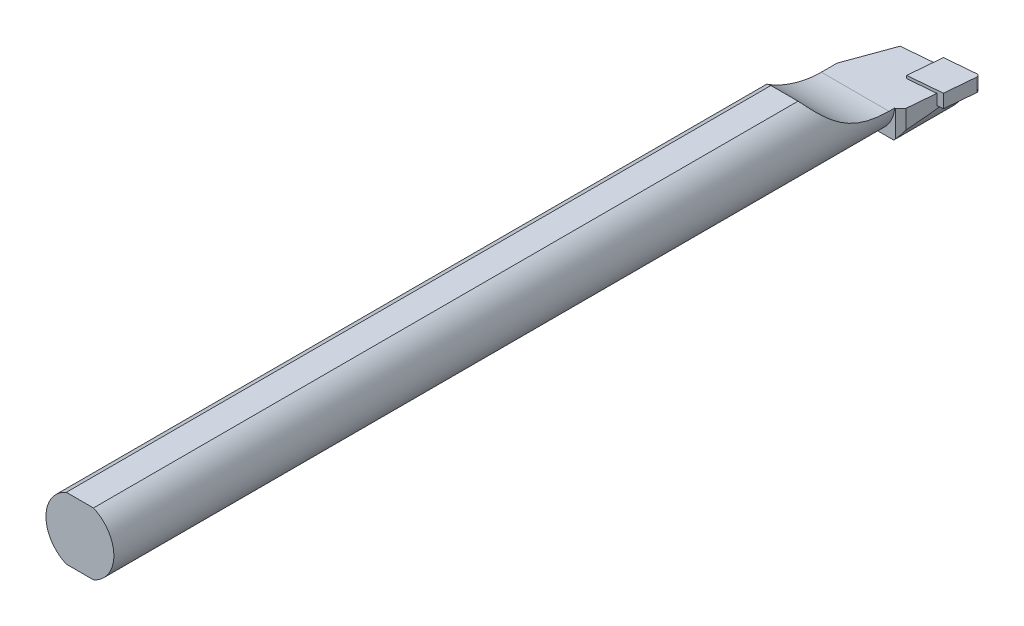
ISO-10303-21;
HEADER;
FILE_DESCRIPTION(('STEP AP214'),'2;1');
FILE_NAME('part.step','',(''),(''),'','','');
FILE_SCHEMA(('AUTOMOTIVE_DESIGN { 1 0 10303 214 1 1 1 1 }'));
ENDSEC;
DATA;
#1=APPLICATION_CONTEXT('core data for automotive mechanical design processes');
#2=APPLICATION_PROTOCOL_DEFINITION('international standard','automotive_design',2000,#1);
#3=PRODUCT_CONTEXT('',#1,'mechanical');
#4=PRODUCT('Part','Part','',(#3));
#5=PRODUCT_RELATED_PRODUCT_CATEGORY('part','',(#4));
#6=PRODUCT_DEFINITION_FORMATION('','',#4);
#7=PRODUCT_DEFINITION_CONTEXT('part definition',#1,'design');
#8=PRODUCT_DEFINITION('design','',#6,#7);
#9=PRODUCT_DEFINITION_SHAPE('','',#8);
#10=(LENGTH_UNIT() NAMED_UNIT(*) SI_UNIT(.MILLI.,.METRE.));
#11=(NAMED_UNIT(*) PLANE_ANGLE_UNIT() SI_UNIT($,.RADIAN.));
#12=(NAMED_UNIT(*) SI_UNIT($,.STERADIAN.) SOLID_ANGLE_UNIT());
#13=UNCERTAINTY_MEASURE_WITH_UNIT(LENGTH_MEASURE(1.E-05),#10,'distance_accuracy_value','');
#14=(GEOMETRIC_REPRESENTATION_CONTEXT(3) GLOBAL_UNCERTAINTY_ASSIGNED_CONTEXT((#13)) GLOBAL_UNIT_ASSIGNED_CONTEXT((#10,
#11,#12)) REPRESENTATION_CONTEXT('',''));
#15=CARTESIAN_POINT('',(0.,0.,0.));
#16=DIRECTION('',(0.,0.,1.));
#17=DIRECTION('',(1.,0.,0.));
#18=AXIS2_PLACEMENT_3D('',#15,#16,#17);
#19=CARTESIAN_POINT('',(-8.99999999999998,0.,150.));
#20=DIRECTION('',(0.,0.,1.));
#21=DIRECTION('',(1.,0.,0.));
#22=AXIS2_PLACEMENT_3D('',#19,#20,#21);
#23=CYLINDRICAL_SURFACE('',#22,6.00000000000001);
#24=CARTESIAN_POINT('',(-9.,0.,1.79121780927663));
#25=DIRECTION('',(0.0871557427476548,0.,0.996194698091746));
#26=DIRECTION('',(-0.996194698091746,0.,0.0871557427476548));
#27=AXIS2_PLACEMENT_3D('',#24,#25,#26);
#28=ELLIPSE('',#27,6.02291902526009,6.00000000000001);
#29=CARTESIAN_POINT('',(-12.,-5.19615242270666,2.05368379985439));
#30=VERTEX_POINT('',#29);
#31=CARTESIAN_POINT('',(-11.3979157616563,-5.50000000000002,2.00100825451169));
#32=VERTEX_POINT('',#31);
#33=EDGE_CURVE('E167',#30,#32,#28,.T.);
#34=ORIENTED_EDGE('',*,*,#33,.T.);
#35=DIRECTION('',(0.,0.,1.));
#36=VECTOR('',#35,1.);
#37=CARTESIAN_POINT('',(-11.3979157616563,-5.50000000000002,150.));
#38=LINE('',#37,#36);
#39=CARTESIAN_POINT('',(-11.3979157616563,-5.50000000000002,150.));
#40=VERTEX_POINT('',#39);
#41=EDGE_CURVE('E156',#32,#40,#38,.T.);
#42=ORIENTED_EDGE('',*,*,#41,.T.);
#43=CARTESIAN_POINT('',(-8.99999999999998,0.,150.));
#44=DIRECTION('',(0.,0.,1.));
#45=DIRECTION('',(1.,0.,0.));
#46=AXIS2_PLACEMENT_3D('',#43,#44,#45);
#47=CIRCLE('',#46,6.00000000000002);
#48=CARTESIAN_POINT('',(-11.3979157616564,5.49999999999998,150.));
#49=VERTEX_POINT('',#48);
#50=EDGE_CURVE('E165',#49,#40,#47,.T.);
#51=ORIENTED_EDGE('',*,*,#50,.F.);
#52=DIRECTION('',(0.,0.,1.));
#53=VECTOR('',#52,1.);
#54=CARTESIAN_POINT('',(-11.3979157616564,5.49999999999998,150.));
#55=LINE('',#54,#53);
#56=CARTESIAN_POINT('',(-11.3979157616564,5.5,25.4899959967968));
#57=VERTEX_POINT('',#56);
#58=EDGE_CURVE('E303',#49,#57,#55,.F.);
#59=ORIENTED_EDGE('',*,*,#58,.T.);
#60=CARTESIAN_POINT('',(-3.02086962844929,-0.5,13.));
#61=CARTESIAN_POINT('',(-3.02089370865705,-0.500003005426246,13.2238125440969));
#62=CARTESIAN_POINT('',(-3.02047773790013,-0.495303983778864,13.4476242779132));
#63=CARTESIAN_POINT('',(-3.01893904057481,-0.476523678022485,13.8948495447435));
#64=CARTESIAN_POINT('',(-3.01781632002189,-0.4624424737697,14.1182630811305));
#65=CARTESIAN_POINT('',(-3.01503689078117,-0.424911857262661,14.5643911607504));
#66=CARTESIAN_POINT('',(-3.01337996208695,-0.401458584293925,14.7871053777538));
#67=CARTESIAN_POINT('',(-3.00987333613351,-0.345226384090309,15.2313512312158));
#68=CARTESIAN_POINT('',(-3.00802363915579,-0.312447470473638,15.4528828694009));
#69=CARTESIAN_POINT('',(-3.00457726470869,-0.237337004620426,15.8960518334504));
#70=CARTESIAN_POINT('',(-3.00298261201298,-0.194934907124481,16.1176772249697));
#71=CARTESIAN_POINT('',(-3.000661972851,-0.10079597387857,16.5589408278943));
#72=CARTESIAN_POINT('',(-2.99993598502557,-0.0490591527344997,16.7785790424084));
#73=CARTESIAN_POINT('',(-3.00007287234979,0.0636391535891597,17.2154029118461));
#74=CARTESIAN_POINT('',(-3.00093522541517,0.124597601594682,17.4325893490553));
#75=CARTESIAN_POINT('',(-3.00509008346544,0.255627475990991,17.8641511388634));
#76=CARTESIAN_POINT('',(-3.00838243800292,0.325698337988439,18.0785266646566));
#77=CARTESIAN_POINT('',(-3.02069289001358,0.509897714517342,18.6041674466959));
#78=CARTESIAN_POINT('',(-3.03167566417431,0.629247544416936,18.913581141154));
#79=CARTESIAN_POINT('',(-3.06446648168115,0.886723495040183,19.5239441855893));
#80=CARTESIAN_POINT('',(-3.08627476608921,1.02485003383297,19.824893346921));
#81=CARTESIAN_POINT('',(-3.144723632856,1.31835323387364,20.4154719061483));
#82=CARTESIAN_POINT('',(-3.18131048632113,1.47366594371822,20.7051381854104));
#83=CARTESIAN_POINT('',(-3.27395786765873,1.80034860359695,21.2720246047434));
#84=CARTESIAN_POINT('',(-3.3300094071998,1.97171111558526,21.5492504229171));
#85=CARTESIAN_POINT('',(-3.44339242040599,2.26712876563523,21.9964721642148));
#86=CARTESIAN_POINT('',(-3.49375751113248,2.38736803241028,22.170772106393));
#87=CARTESIAN_POINT('',(-3.60672556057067,2.6326449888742,22.5118475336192));
#88=CARTESIAN_POINT('',(-3.66932503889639,2.75768130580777,22.6786251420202));
#89=CARTESIAN_POINT('',(-3.80826175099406,3.01109848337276,23.0034867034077));
#90=CARTESIAN_POINT('',(-3.88458710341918,3.13947636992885,23.1615780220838));
#91=CARTESIAN_POINT('',(-4.05247942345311,3.39790612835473,23.4680207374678));
#92=CARTESIAN_POINT('',(-4.144043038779,3.5279576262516,23.616374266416));
#93=CARTESIAN_POINT('',(-4.32291745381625,3.76054803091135,23.8723815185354));
#94=CARTESIAN_POINT('',(-4.40716052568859,3.86319015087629,23.9820880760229));
#95=CARTESIAN_POINT('',(-4.58649985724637,4.06686954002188,24.1939768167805));
#96=CARTESIAN_POINT('',(-4.68159887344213,4.16790639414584,24.2961570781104));
#97=CARTESIAN_POINT('',(-4.88291459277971,4.36687930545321,24.4923081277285));
#98=CARTESIAN_POINT('',(-4.9891319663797,4.46481517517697,24.5862784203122));
#99=CARTESIAN_POINT('',(-5.21265502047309,4.65592349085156,24.7653365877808));
#100=CARTESIAN_POINT('',(-5.32995502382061,4.74909833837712,24.8504289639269));
#101=CARTESIAN_POINT('',(-5.57654306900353,4.92985989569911,25.0119510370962));
#102=CARTESIAN_POINT('',(-5.70592997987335,5.01738841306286,25.0882953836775));
#103=CARTESIAN_POINT('',(-5.9751907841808,5.18416858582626,25.2309309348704));
#104=CARTESIAN_POINT('',(-6.11506502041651,5.26341997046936,25.2972218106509));
#105=CARTESIAN_POINT('',(-6.40428940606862,5.41190316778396,25.4193214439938));
#106=CARTESIAN_POINT('',(-6.55363444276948,5.4811403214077,25.475135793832));
#107=CARTESIAN_POINT('',(-6.8606150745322,5.60808384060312,25.5760319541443));
#108=CARTESIAN_POINT('',(-7.01824921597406,5.66579221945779,25.6211156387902));
#109=CARTESIAN_POINT('',(-7.31700971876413,5.76094240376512,25.6946377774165));
#110=CARTESIAN_POINT('',(-7.45723124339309,5.8001076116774,25.7245399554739));
#111=CARTESIAN_POINT('',(-7.74155756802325,5.8683634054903,25.7762833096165));
#112=CARTESIAN_POINT('',(-7.88566199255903,5.89745496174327,25.7981252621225));
#113=CARTESIAN_POINT('',(-8.17654082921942,5.94505077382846,25.8336989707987));
#114=CARTESIAN_POINT('',(-8.32331426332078,5.9635588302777,25.847433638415));
#115=CARTESIAN_POINT('',(-8.61835866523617,5.98968105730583,25.866782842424));
#116=CARTESIAN_POINT('',(-8.76662957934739,5.99729561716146,25.8723976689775));
#117=CARTESIAN_POINT('',(-9.0522374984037,6.00134241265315,25.8753836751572));
#118=CARTESIAN_POINT('',(-9.18955802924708,5.99857269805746,25.8733431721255));
#119=CARTESIAN_POINT('',(-9.46345421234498,5.98364642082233,25.8623132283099));
#120=CARTESIAN_POINT('',(-9.60002961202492,5.97148685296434,25.8533215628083));
#121=CARTESIAN_POINT('',(-9.87132314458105,5.93796825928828,25.8284053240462));
#122=CARTESIAN_POINT('',(-10.0060423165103,5.91661461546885,25.8124848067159));
#123=CARTESIAN_POINT('',(-10.2728064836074,5.86501719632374,25.7737287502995));
#124=CARTESIAN_POINT('',(-10.4048504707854,5.83477013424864,25.7508906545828));
#125=CARTESIAN_POINT('',(-10.6645072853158,5.76605068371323,25.6985071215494));
#126=CARTESIAN_POINT('',(-10.7921424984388,5.72763041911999,25.6690041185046));
#127=CARTESIAN_POINT('',(-11.0430691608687,5.642996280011,25.6032673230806));
#128=CARTESIAN_POINT('',(-11.166359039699,5.59677962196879,25.5670311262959));
#129=CARTESIAN_POINT('',(-11.4077814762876,5.49723852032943,25.4879461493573));
#130=CARTESIAN_POINT('',(-11.5259158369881,5.44391658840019,25.4450997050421));
#131=CARTESIAN_POINT('',(-11.756496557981,5.33087432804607,25.3529025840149));
#132=CARTESIAN_POINT('',(-11.8689408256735,5.27115167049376,25.303549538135));
#133=CARTESIAN_POINT('',(-12.0926992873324,5.14320772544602,25.196071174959));
#134=CARTESIAN_POINT('',(-12.2037159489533,5.07471991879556,25.1376439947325));
#135=CARTESIAN_POINT('',(-12.4185303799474,4.93257010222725,25.0140873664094));
#136=CARTESIAN_POINT('',(-12.5223252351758,4.85890602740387,24.9489552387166));
#137=CARTESIAN_POINT('',(-12.722381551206,4.70740065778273,24.8122903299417));
#138=CARTESIAN_POINT('',(-12.8186424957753,4.62955907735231,24.7407571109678));
#139=CARTESIAN_POINT('',(-13.0035083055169,4.47065832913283,24.5916135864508));
#140=CARTESIAN_POINT('',(-13.0921117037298,4.38959854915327,24.5140021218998));
#141=CARTESIAN_POINT('',(-13.2938489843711,4.1939710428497,24.3224935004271));
#142=CARTESIAN_POINT('',(-13.4035292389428,4.0783627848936,24.2060047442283));
#143=CARTESIAN_POINT('',(-13.6086977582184,3.84500547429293,23.9630968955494));
#144=CARTESIAN_POINT('',(-13.7041817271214,3.72725578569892,23.8366748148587));
#145=CARTESIAN_POINT('',(-13.8817752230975,3.49143034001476,23.5747499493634));
#146=CARTESIAN_POINT('',(-13.9638690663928,3.37335436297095,23.4392367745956));
#147=CARTESIAN_POINT('',(-14.1155276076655,3.13861635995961,23.1601909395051));
#148=CARTESIAN_POINT('',(-14.1850885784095,3.02195476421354,23.0166559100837));
#149=CARTESIAN_POINT('',(-14.3398933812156,2.74240983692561,22.6599531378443));
#150=CARTESIAN_POINT('',(-14.4192468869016,2.58094341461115,22.4431067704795));
#151=CARTESIAN_POINT('',(-14.5580908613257,2.26653593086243,21.9972203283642));
#152=CARTESIAN_POINT('',(-14.6175726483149,2.11359861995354,21.7681749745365));
#153=CARTESIAN_POINT('',(-14.7200939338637,1.8179807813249,21.299355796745));
#154=CARTESIAN_POINT('',(-14.7630979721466,1.67532290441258,21.0595600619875));
#155=CARTESIAN_POINT('',(-14.8356098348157,1.40200990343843,20.5713278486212));
#156=CARTESIAN_POINT('',(-14.8651179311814,1.27135453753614,20.3228915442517));
#157=CARTESIAN_POINT('',(-14.9250884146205,0.963540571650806,19.6980470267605));
#158=CARTESIAN_POINT('',(-14.9492597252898,0.794020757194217,19.3172524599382));
#159=CARTESIAN_POINT('',(-14.9823818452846,0.485013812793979,18.5429420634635));
#160=CARTESIAN_POINT('',(-14.9913245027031,0.345542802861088,18.1494195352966));
#161=CARTESIAN_POINT('',(-15.0004829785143,0.0978005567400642,17.3527241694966));
#162=CARTESIAN_POINT('',(-15.0007013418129,-0.0104797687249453,16.9495541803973));
#163=CARTESIAN_POINT('',(-14.9975365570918,-0.195159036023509,16.1362137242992));
#164=CARTESIAN_POINT('',(-14.9941551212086,-0.271573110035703,15.7260466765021));
#165=CARTESIAN_POINT('',(-14.9877121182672,-0.387878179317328,14.9301337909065));
#166=CARTESIAN_POINT('',(-14.9846448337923,-0.429968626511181,14.5447105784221));
#167=CARTESIAN_POINT('',(-14.9814196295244,-0.472004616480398,13.9656208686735));
#168=CARTESIAN_POINT('',(-14.9805740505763,-0.48250000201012,13.7726743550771));
#169=CARTESIAN_POINT('',(-14.9794243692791,-0.496498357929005,13.3864908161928));
#170=CARTESIAN_POINT('',(-14.9791203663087,-0.50000004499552,13.1932537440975));
#171=CARTESIAN_POINT('',(-14.9791303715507,-0.500000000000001,13.));
#172=B_SPLINE_CURVE_WITH_KNOTS('',3,(#60,#61,#62,#63,#64,#65,#66,#67,#68,#69,#70,#71,#72,#73,
#74,#75,#76,#77,#78,#79,#80,#81,#82,#83,#84,#85,#86,#87,#88,#89,#90,#91,#92,#93,#94,#95,#96,#97,
#98,#99,#100,#101,#102,#103,#104,#105,#106,#107,#108,#109,#110,#111,#112,#113,#114,#115,#116,
#117,#118,#119,#120,#121,#122,#123,#124,#125,#126,#127,#128,#129,#130,#131,#132,#133,#134,#135,
#136,#137,#138,#139,#140,#141,#142,#143,#144,#145,#146,#147,#148,#149,#150,#151,#152,#153,#154,
#155,#156,#157,#158,#159,#160,#161,#162,#163,#164,#165,#166,#167,#168,#169,#170,#171),
.UNSPECIFIED.,.F.,.F.,(4,2,2,2,2,2,2,2,2,2,2,2,2,2,2,2,2,2,2,2,2,2,2,2,2,2,2,2,2,2,2,2,2,2,2,2,
2,2,2,2,2,2,2,2,2,2,2,2,2,2,2,2,2,2,2,4),(0.,0.671386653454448,1.34276759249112,
2.01442538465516,2.68608219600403,3.36283162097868,4.03957998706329,4.71610594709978,
5.39259002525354,6.38724248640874,7.38191709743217,8.37300756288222,9.36364097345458,
10.0161627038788,10.6684990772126,11.3202734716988,11.9719046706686,12.48817185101,
13.0045704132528,13.5210001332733,14.0371667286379,14.5580038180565,15.0788579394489,
15.5994332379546,16.1199175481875,16.5652139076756,17.0104673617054,17.4555608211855,
17.9006383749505,18.3122372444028,18.723967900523,19.1354578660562,19.5471000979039,
19.9561918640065,20.3654299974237,20.7745238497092,21.1837670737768,21.6121053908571,
22.04061556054,22.4691550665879,22.8977764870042,23.4890824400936,24.0805669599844,
24.67273938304,25.265087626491,26.1090623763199,26.9534053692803,27.7995553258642,
28.6456882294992,29.8964309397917,31.1478429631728,32.3988899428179,33.64934216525,
34.8114250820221,35.3910148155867,35.9707108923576),.UNSPECIFIED.);
#173=CARTESIAN_POINT('',(-14.9791303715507,-0.5,13.));
#174=VERTEX_POINT('',#173);
#175=EDGE_CURVE('E185',#57,#174,#172,.T.);
#176=ORIENTED_EDGE('',*,*,#175,.T.);
#177=DIRECTION('',(0.,0.,1.));
#178=VECTOR('',#177,1.);
#179=CARTESIAN_POINT('',(-14.9791303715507,-0.500000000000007,150.));
#180=LINE('',#179,#178);
#181=CARTESIAN_POINT('',(-14.9791303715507,-0.499999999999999,10.2387772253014));
#182=VERTEX_POINT('',#181);
#183=EDGE_CURVE('E290',#174,#182,#180,.F.);
#184=ORIENTED_EDGE('',*,*,#183,.T.);
#185=CARTESIAN_POINT('',(-9.,0.,-6.18874845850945));
#186=DIRECTION('',(0.939692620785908,0.,0.342020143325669));
#187=DIRECTION('',(-0.342020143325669,0.,0.939692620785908));
#188=AXIS2_PLACEMENT_3D('',#185,#186,#187);
#189=ELLIPSE('',#188,17.5428264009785,6.00000000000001);
#190=EDGE_CURVE('E175',#182,#30,#189,.T.);
#191=ORIENTED_EDGE('',*,*,#190,.T.);
#192=EDGE_LOOP('',(#34,#42,#51,#59,#176,#184,#191));
#193=FACE_BOUND('',#192,.T.);
#194=ADVANCED_FACE('F31',(#193),#23,.T.);
#195=CARTESIAN_POINT('',(-8.99999999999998,0.,50.));
#196=DIRECTION('',(0.,0.,-1.));
#197=DIRECTION('',(-1.,0.,0.));
#198=AXIS2_PLACEMENT_3D('',#195,#196,#197);
#199=CYLINDRICAL_SURFACE('',#198,8.);
#200=DIRECTION('',(0.,0.,-1.));
#201=VECTOR('',#200,1.);
#202=CARTESIAN_POINT('',(-3.19052498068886,-5.50000000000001,50.));
#203=LINE('',#202,#201);
#204=CARTESIAN_POINT('',(-3.19052498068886,-5.5,1.28295460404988));
#205=VERTEX_POINT('',#204);
#206=CARTESIAN_POINT('',(-3.19052498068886,-5.5,12.));
#207=VERTEX_POINT('',#206);
#208=EDGE_CURVE('E252',#205,#207,#203,.F.);
#209=ORIENTED_EDGE('',*,*,#208,.F.);
#210=CARTESIAN_POINT('',(-8.99999999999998,0.,1.79121780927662));
#211=DIRECTION('',(0.0871557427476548,0.,0.996194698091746));
#212=DIRECTION('',(0.996194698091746,0.,-0.0871557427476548));
#213=AXIS2_PLACEMENT_3D('',#210,#211,#212);
#214=ELLIPSE('',#213,8.03055870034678,8.);
#215=CARTESIAN_POINT('',(-1.36222545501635,-2.38,1.12299912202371));
#216=VERTEX_POINT('',#215);
#217=EDGE_CURVE('E261',#205,#216,#214,.T.);
#218=ORIENTED_EDGE('',*,*,#217,.T.);
#219=DIRECTION('',(0.,0.,-1.));
#220=VECTOR('',#219,1.);
#221=CARTESIAN_POINT('',(-1.36222545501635,-2.38,50.));
#222=LINE('',#221,#220);
#223=CARTESIAN_POINT('',(-1.36222545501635,-2.38,4.09659495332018));
#224=VERTEX_POINT('',#223);
#225=EDGE_CURVE('E193',#216,#224,#222,.F.);
#226=ORIENTED_EDGE('',*,*,#225,.T.);
#227=CARTESIAN_POINT('',(-8.99999999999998,0.,91.3967574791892));
#228=DIRECTION('',(0.996194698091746,0.,0.0871557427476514));
#229=DIRECTION('',(0.0871557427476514,0.,-0.996194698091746));
#230=AXIS2_PLACEMENT_3D('',#227,#228,#229);
#231=ELLIPSE('',#230,91.789705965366,8.);
#232=CARTESIAN_POINT('',(-1.97162029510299,-3.82124046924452,11.062009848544));
#233=VERTEX_POINT('',#232);
#234=EDGE_CURVE('E257',#233,#224,#231,.T.);
#235=ORIENTED_EDGE('',*,*,#234,.F.);
#236=CARTESIAN_POINT('',(-8.99999999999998,0.,18.090389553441));
#237=DIRECTION('',(0.707106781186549,0.,0.707106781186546));
#238=DIRECTION('',(0.707106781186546,0.,-0.707106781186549));
#239=AXIS2_PLACEMENT_3D('',#236,#237,#238);
#240=ELLIPSE('',#239,11.3137084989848,8.);
#241=CARTESIAN_POINT('',(-2.90961044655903,-5.18721072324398,12.));
#242=VERTEX_POINT('',#241);
#243=EDGE_CURVE('E255',#242,#233,#240,.T.);
#244=ORIENTED_EDGE('',*,*,#243,.F.);
#245=CARTESIAN_POINT('',(-8.99999999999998,0.,12.));
#246=DIRECTION('',(0.,0.,1.));
#247=DIRECTION('',(0.,-1.,0.));
#248=AXIS2_PLACEMENT_3D('',#245,#246,#247);
#249=CIRCLE('',#248,8.);
#250=EDGE_CURVE('E246',#207,#242,#249,.T.);
#251=ORIENTED_EDGE('',*,*,#250,.F.);
#252=EDGE_LOOP('',(#209,#218,#226,#235,#244,#251));
#253=FACE_BOUND('',#252,.T.);
#254=ADVANCED_FACE('F213',(#253),#199,.T.);
#255=CARTESIAN_POINT('',(-12.,-50.,2.05368379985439));
#256=DIRECTION('',(0.0871557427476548,0.,0.996194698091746));
#257=DIRECTION('',(0.996194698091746,0.,-0.0871557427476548));
#258=AXIS2_PLACEMENT_3D('',#255,#256,#257);
#259=PLANE('',#258);
#260=ORIENTED_EDGE('',*,*,#217,.F.);
#261=DIRECTION('',(-0.996194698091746,0.,0.0871557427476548));
#262=VECTOR('',#261,1.);
#263=CARTESIAN_POINT('',(-12.,-5.5,2.05368379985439));
#264=LINE('',#263,#262);
#265=EDGE_CURVE('E250',#205,#32,#264,.T.);
#266=ORIENTED_EDGE('',*,*,#265,.T.);
#267=ORIENTED_EDGE('',*,*,#33,.F.);
#268=DIRECTION('',(0.,1.,0.));
#269=VECTOR('',#268,1.);
#270=CARTESIAN_POINT('',(-12.,-50.,2.05368379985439));
#271=LINE('',#270,#269);
#272=CARTESIAN_POINT('',(-12.,-0.5,2.05368379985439));
#273=VERTEX_POINT('',#272);
#274=EDGE_CURVE('E177',#30,#273,#271,.T.);
#275=ORIENTED_EDGE('',*,*,#274,.T.);
#276=DIRECTION('',(0.996194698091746,0.,-0.0871557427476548));
#277=VECTOR('',#276,1.);
#278=CARTESIAN_POINT('',(-12.,-0.5,2.05368379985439));
#279=LINE('',#278,#277);
#280=CARTESIAN_POINT('',(-6.01966205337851,-0.5,1.53047202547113));
#281=VERTEX_POINT('',#280);
#282=EDGE_CURVE('E182',#273,#281,#279,.T.);
#283=ORIENTED_EDGE('',*,*,#282,.T.);
#284=DIRECTION('',(0.,-1.,0.));
#285=VECTOR('',#284,1.);
#286=CARTESIAN_POINT('',(-6.01966205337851,-50.,1.53047202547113));
#287=LINE('',#286,#285);
#288=CARTESIAN_POINT('',(-6.01966205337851,-2.38,1.53047202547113));
#289=VERTEX_POINT('',#288);
#290=EDGE_CURVE('E258',#281,#289,#287,.T.);
#291=ORIENTED_EDGE('',*,*,#290,.T.);
#292=DIRECTION('',(-0.996194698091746,0.,0.0871557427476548));
#293=VECTOR('',#292,1.);
#294=CARTESIAN_POINT('',(-12.,-2.38,2.05368379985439));
#295=LINE('',#294,#293);
#296=EDGE_CURVE('E313',#216,#289,#295,.T.);
#297=ORIENTED_EDGE('',*,*,#296,.F.);
#298=EDGE_LOOP('',(#260,#266,#267,#275,#283,#291,#297));
#299=FACE_BOUND('',#298,.T.);
#300=ADVANCED_FACE('F209',(#299),#259,.F.);
#301=CARTESIAN_POINT('',(-11.,-8.,12.));
#302=DIRECTION('',(0.,0.,1.));
#303=DIRECTION('',(0.,-1.,0.));
#304=AXIS2_PLACEMENT_3D('',#301,#302,#303);
#305=PLANE('',#304);
#306=DIRECTION('',(-1.,0.,0.));
#307=VECTOR('',#306,1.);
#308=CARTESIAN_POINT('',(-11.,-5.5,12.));
#309=LINE('',#308,#307);
#310=CARTESIAN_POINT('',(-6.60208423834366,-5.50000000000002,12.));
#311=VERTEX_POINT('',#310);
#312=EDGE_CURVE('E168',#207,#311,#309,.T.);
#313=ORIENTED_EDGE('',*,*,#312,.F.);
#314=ORIENTED_EDGE('',*,*,#250,.T.);
#315=DIRECTION('',(0.,1.,0.));
#316=VECTOR('',#315,1.);
#317=CARTESIAN_POINT('',(-2.90961044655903,-8.,12.));
#318=LINE('',#317,#316);
#319=CARTESIAN_POINT('',(-2.90961044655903,-0.499999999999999,12.));
#320=VERTEX_POINT('',#319);
#321=EDGE_CURVE('E279',#242,#320,#318,.T.);
#322=ORIENTED_EDGE('',*,*,#321,.T.);
#323=DIRECTION('',(1.,0.,0.));
#324=VECTOR('',#323,1.);
#325=CARTESIAN_POINT('',(-11.,-0.499999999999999,12.));
#326=LINE('',#325,#324);
#327=CARTESIAN_POINT('',(-3.02086962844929,-0.499999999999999,12.));
#328=VERTEX_POINT('',#327);
#329=EDGE_CURVE('E273',#328,#320,#326,.T.);
#330=ORIENTED_EDGE('',*,*,#329,.F.);
#331=CARTESIAN_POINT('',(-9.,0.,12.));
#332=DIRECTION('',(0.,0.,1.));
#333=DIRECTION('',(0.,-1.,0.));
#334=AXIS2_PLACEMENT_3D('',#331,#332,#333);
#335=CIRCLE('',#334,6.00000000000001);
#336=EDGE_CURVE('E249',#311,#328,#335,.T.);
#337=ORIENTED_EDGE('',*,*,#336,.F.);
#338=EDGE_LOOP('',(#313,#314,#322,#330,#337));
#339=FACE_BOUND('',#338,.T.);
#340=ADVANCED_FACE('F212',(#339),#305,.T.);
#341=CARTESIAN_POINT('',(-1.97162029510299,-8.,11.062009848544));
#342=DIRECTION('',(0.996194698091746,0.,0.0871557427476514));
#343=DIRECTION('',(0.0871557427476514,0.,-0.996194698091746));
#344=AXIS2_PLACEMENT_3D('',#341,#342,#343);
#345=PLANE('',#344);
#346=DIRECTION('',(0.,-1.,0.));
#347=VECTOR('',#346,1.);
#348=CARTESIAN_POINT('',(-1.53047202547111,-8.,6.01966205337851));
#349=LINE('',#348,#347);
#350=CARTESIAN_POINT('',(-1.5304720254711,-0.5,6.01966205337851));
#351=VERTEX_POINT('',#350);
#352=CARTESIAN_POINT('',(-1.53047202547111,-2.38,6.01966205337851));
#353=VERTEX_POINT('',#352);
#354=EDGE_CURVE('E264',#351,#353,#349,.T.);
#355=ORIENTED_EDGE('',*,*,#354,.F.);
#356=DIRECTION('',(0.0871557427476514,0.,-0.996194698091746));
#357=VECTOR('',#356,1.);
#358=CARTESIAN_POINT('',(-1.97162029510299,-0.499999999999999,11.062009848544));
#359=LINE('',#358,#357);
#360=CARTESIAN_POINT('',(-1.97162029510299,-0.499999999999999,11.062009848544));
#361=VERTEX_POINT('',#360);
#362=EDGE_CURVE('E270',#361,#351,#359,.T.);
#363=ORIENTED_EDGE('',*,*,#362,.F.);
#364=DIRECTION('',(0.,1.,0.));
#365=VECTOR('',#364,1.);
#366=CARTESIAN_POINT('',(-1.97162029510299,-8.,11.062009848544));
#367=LINE('',#366,#365);
#368=EDGE_CURVE('E280',#233,#361,#367,.T.);
#369=ORIENTED_EDGE('',*,*,#368,.F.);
#370=ORIENTED_EDGE('',*,*,#234,.T.);
#371=DIRECTION('',(-0.0871557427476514,0.,0.996194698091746));
#372=VECTOR('',#371,1.);
#373=CARTESIAN_POINT('',(-1.97162029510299,-2.38,11.062009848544));
#374=LINE('',#373,#372);
#375=EDGE_CURVE('E310',#224,#353,#374,.T.);
#376=ORIENTED_EDGE('',*,*,#375,.T.);
#377=EDGE_LOOP('',(#355,#363,#369,#370,#376));
#378=FACE_BOUND('',#377,.T.);
#379=ADVANCED_FACE('F203',(#378),#345,.T.);
#380=CARTESIAN_POINT('',(-2.90961044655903,-8.,12.));
#381=DIRECTION('',(0.707106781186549,0.,0.707106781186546));
#382=DIRECTION('',(0.707106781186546,0.,-0.707106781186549));
#383=AXIS2_PLACEMENT_3D('',#380,#381,#382);
#384=PLANE('',#383);
#385=ORIENTED_EDGE('',*,*,#321,.F.);
#386=ORIENTED_EDGE('',*,*,#243,.T.);
#387=ORIENTED_EDGE('',*,*,#368,.T.);
#388=DIRECTION('',(0.707106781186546,0.,-0.707106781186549));
#389=VECTOR('',#388,1.);
#390=CARTESIAN_POINT('',(-2.90961044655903,-0.499999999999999,12.));
#391=LINE('',#390,#389);
#392=EDGE_CURVE('E276',#320,#361,#391,.T.);
#393=ORIENTED_EDGE('',*,*,#392,.F.);
#394=EDGE_LOOP('',(#385,#386,#387,#393));
#395=FACE_BOUND('',#394,.T.);
#396=ADVANCED_FACE('F221',(#395),#384,.T.);
#397=CARTESIAN_POINT('',(-6.60208423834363,-5.50000000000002,150.));
#398=VERTEX_POINT('',#397);
#399=CARTESIAN_POINT('',(-6.60208423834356,5.49999999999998,150.));
#400=VERTEX_POINT('',#399);
#401=EDGE_CURVE('E173',#398,#400,#47,.T.);
#402=ORIENTED_EDGE('',*,*,#401,.F.);
#403=DIRECTION('',(0.,0.,1.));
#404=VECTOR('',#403,1.);
#405=CARTESIAN_POINT('',(-6.60208423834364,-5.50000000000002,150.));
#406=LINE('',#405,#404);
#407=EDGE_CURVE('E47',#398,#311,#406,.F.);
#408=ORIENTED_EDGE('',*,*,#407,.T.);
#409=ORIENTED_EDGE('',*,*,#336,.T.);
#410=DIRECTION('',(0.,0.,1.));
#411=VECTOR('',#410,1.);
#412=CARTESIAN_POINT('',(-3.02086962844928,-0.500000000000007,150.));
#413=LINE('',#412,#411);
#414=CARTESIAN_POINT('',(-3.02086962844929,-0.5,13.));
#415=VERTEX_POINT('',#414);
#416=EDGE_CURVE('E292',#328,#415,#413,.T.);
#417=ORIENTED_EDGE('',*,*,#416,.T.);
#418=CARTESIAN_POINT('',(-6.60208423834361,5.5,25.4899959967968));
#419=VERTEX_POINT('',#418);
#420=EDGE_CURVE('E186',#415,#419,#172,.T.);
#421=ORIENTED_EDGE('',*,*,#420,.T.);
#422=DIRECTION('',(0.,0.,1.));
#423=VECTOR('',#422,1.);
#424=CARTESIAN_POINT('',(-6.60208423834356,5.49999999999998,150.));
#425=LINE('',#424,#423);
#426=EDGE_CURVE('E54',#419,#400,#425,.T.);
#427=ORIENTED_EDGE('',*,*,#426,.T.);
#428=EDGE_LOOP('',(#402,#408,#409,#417,#421,#427));
#429=FACE_BOUND('',#428,.T.);
#430=ADVANCED_FACE('F33',(#429),#23,.T.);
#431=CARTESIAN_POINT('',(-8.99999999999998,0.,150.));
#432=DIRECTION('',(0.,0.,-1.));
#433=DIRECTION('',(-1.,0.,0.));
#434=AXIS2_PLACEMENT_3D('',#431,#432,#433);
#435=PLANE('',#434);
#436=ORIENTED_EDGE('',*,*,#50,.T.);
#437=DIRECTION('',(1.,0.,0.));
#438=VECTOR('',#437,1.);
#439=CARTESIAN_POINT('',(-8.99999999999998,-5.50000000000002,150.));
#440=LINE('',#439,#438);
#441=EDGE_CURVE('E11',#40,#398,#440,.T.);
#442=ORIENTED_EDGE('',*,*,#441,.T.);
#443=ORIENTED_EDGE('',*,*,#401,.T.);
#444=DIRECTION('',(-1.,0.,0.));
#445=VECTOR('',#444,1.);
#446=CARTESIAN_POINT('',(-8.99999999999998,5.49999999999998,150.));
#447=LINE('',#446,#445);
#448=EDGE_CURVE('E172',#400,#49,#447,.T.);
#449=ORIENTED_EDGE('',*,*,#448,.T.);
#450=EDGE_LOOP('',(#436,#442,#443,#449));
#451=FACE_BOUND('',#450,.T.);
#452=ADVANCED_FACE('F171',(#451),#435,.F.);
#453=CARTESIAN_POINT('',(-23.6337134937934,-50.,34.0170489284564));
#454=DIRECTION('',(0.939692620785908,0.,0.342020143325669));
#455=DIRECTION('',(0.342020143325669,0.,-0.939692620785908));
#456=AXIS2_PLACEMENT_3D('',#453,#454,#455);
#457=PLANE('',#456);
#458=ORIENTED_EDGE('',*,*,#190,.F.);
#459=DIRECTION('',(0.342020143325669,0.,-0.939692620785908));
#460=VECTOR('',#459,1.);
#461=CARTESIAN_POINT('',(-23.6337134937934,-0.5,34.0170489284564));
#462=LINE('',#461,#460);
#463=EDGE_CURVE('E287',#182,#273,#462,.T.);
#464=ORIENTED_EDGE('',*,*,#463,.T.);
#465=ORIENTED_EDGE('',*,*,#274,.F.);
#466=EDGE_LOOP('',(#458,#464,#465));
#467=FACE_BOUND('',#466,.T.);
#468=ADVANCED_FACE('F201',(#467),#457,.F.);
#469=CARTESIAN_POINT('',(-50.,15.5,13.));
#470=DIRECTION('',(1.,0.,0.));
#471=DIRECTION('',(0.,0.,-1.));
#472=AXIS2_PLACEMENT_3D('',#469,#470,#471);
#473=CYLINDRICAL_SURFACE('',#472,16.);
#474=ORIENTED_EDGE('',*,*,#175,.F.);
#475=DIRECTION('',(1.,0.,0.));
#476=VECTOR('',#475,1.);
#477=CARTESIAN_POINT('',(-50.,5.5,25.4899959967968));
#478=LINE('',#477,#476);
#479=EDGE_CURVE('E40',#57,#419,#478,.T.);
#480=ORIENTED_EDGE('',*,*,#479,.T.);
#481=ORIENTED_EDGE('',*,*,#420,.F.);
#482=DIRECTION('',(1.,0.,0.));
#483=VECTOR('',#482,1.);
#484=CARTESIAN_POINT('',(-50.,-0.5,13.));
#485=LINE('',#484,#483);
#486=EDGE_CURVE('E284',#174,#415,#485,.T.);
#487=ORIENTED_EDGE('',*,*,#486,.F.);
#488=EDGE_LOOP('',(#474,#480,#481,#487));
#489=FACE_BOUND('',#488,.T.);
#490=ADVANCED_FACE('F195',(#489),#473,.F.);
#491=CARTESIAN_POINT('',(-50.,-0.5,-1.));
#492=DIRECTION('',(0.,-1.,0.));
#493=DIRECTION('',(0.,0.,-1.));
#494=AXIS2_PLACEMENT_3D('',#491,#492,#493);
#495=PLANE('',#494);
#496=DIRECTION('',(-0.996194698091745,0.,0.0871557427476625));
#497=VECTOR('',#496,1.);
#498=CARTESIAN_POINT('',(-49.0223437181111,-0.5,10.1746624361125));
#499=LINE('',#498,#497);
#500=CARTESIAN_POINT('',(-6.45007121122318,-0.5,6.4500712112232));
#501=VERTEX_POINT('',#500);
#502=EDGE_CURVE('E307',#351,#501,#499,.T.);
#503=ORIENTED_EDGE('',*,*,#502,.T.);
#504=DIRECTION('',(0.0871557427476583,0.,-0.996194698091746));
#505=VECTOR('',#504,1.);
#506=CARTESIAN_POINT('',(-6.13403620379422,-0.5,2.83777454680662));
#507=LINE('',#506,#505);
#508=EDGE_CURVE('E362',#501,#281,#507,.T.);
#509=ORIENTED_EDGE('',*,*,#508,.T.);
#510=ORIENTED_EDGE('',*,*,#282,.F.);
#511=ORIENTED_EDGE('',*,*,#463,.F.);
#512=ORIENTED_EDGE('',*,*,#183,.F.);
#513=ORIENTED_EDGE('',*,*,#486,.T.);
#514=ORIENTED_EDGE('',*,*,#416,.F.);
#515=ORIENTED_EDGE('',*,*,#329,.T.);
#516=ORIENTED_EDGE('',*,*,#392,.T.);
#517=ORIENTED_EDGE('',*,*,#362,.T.);
#518=EDGE_LOOP('',(#503,#509,#510,#511,#512,#513,#514,#515,#516,#517));
#519=FACE_BOUND('',#518,.T.);
#520=ADVANCED_FACE('F200',(#519),#495,.F.);
#521=CARTESIAN_POINT('',(-6.45007121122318,-2.38,6.4500712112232));
#522=DIRECTION('',(-0.996194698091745,0.,-0.0871557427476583));
#523=DIRECTION('',(-0.0871557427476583,0.,0.996194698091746));
#524=AXIS2_PLACEMENT_3D('',#521,#522,#523);
#525=PLANE('',#524);
#526=ORIENTED_EDGE('',*,*,#290,.F.);
#527=ORIENTED_EDGE('',*,*,#508,.F.);
#528=DIRECTION('',(0.,1.,0.));
#529=VECTOR('',#528,1.);
#530=CARTESIAN_POINT('',(-6.45007121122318,-2.38,6.4500712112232));
#531=LINE('',#530,#529);
#532=CARTESIAN_POINT('',(-6.45007121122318,0.,6.4500712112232));
#533=VERTEX_POINT('',#532);
#534=EDGE_CURVE('E318',#501,#533,#531,.T.);
#535=ORIENTED_EDGE('',*,*,#534,.T.);
#536=DIRECTION('',(-0.0871557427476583,0.,0.996194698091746));
#537=VECTOR('',#536,1.);
#538=CARTESIAN_POINT('',(-6.45007121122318,0.,6.4500712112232));
#539=LINE('',#538,#537);
#540=CARTESIAN_POINT('',(-5.92713675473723,0.,0.47290302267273));
#541=VERTEX_POINT('',#540);
#542=EDGE_CURVE('E341',#541,#533,#539,.T.);
#543=ORIENTED_EDGE('',*,*,#542,.F.);
#544=DIRECTION('',(0.,1.,0.));
#545=VECTOR('',#544,1.);
#546=CARTESIAN_POINT('',(-5.92713675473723,-2.38,0.47290302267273));
#547=LINE('',#546,#545);
#548=CARTESIAN_POINT('',(-5.92713675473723,-2.38,0.47290302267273));
#549=VERTEX_POINT('',#548);
#550=EDGE_CURVE('E317',#549,#541,#547,.T.);
#551=ORIENTED_EDGE('',*,*,#550,.F.);
#552=DIRECTION('',(-0.0871557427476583,0.,0.996194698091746));
#553=VECTOR('',#552,1.);
#554=CARTESIAN_POINT('',(-6.45007121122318,-2.38,6.4500712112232));
#555=LINE('',#554,#553);
#556=EDGE_CURVE('E331',#549,#289,#555,.T.);
#557=ORIENTED_EDGE('',*,*,#556,.T.);
#558=EDGE_LOOP('',(#526,#527,#535,#543,#551,#557));
#559=FACE_BOUND('',#558,.T.);
#560=ADVANCED_FACE('F207',(#559),#525,.T.);
#561=CARTESIAN_POINT('',(-0.5,-2.38,0.5));
#562=DIRECTION('',(0.,1.,0.));
#563=DIRECTION('',(0.,0.,1.));
#564=AXIS2_PLACEMENT_3D('',#561,#562,#563);
#565=PLANE('',#564);
#566=ORIENTED_EDGE('',*,*,#225,.F.);
#567=ORIENTED_EDGE('',*,*,#296,.T.);
#568=ORIENTED_EDGE('',*,*,#556,.F.);
#569=DIRECTION('',(-0.996194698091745,0.,0.0871557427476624));
#570=VECTOR('',#569,1.);
#571=CARTESIAN_POINT('',(-5.92713675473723,-2.38,0.47290302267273));
#572=LINE('',#571,#570);
#573=CARTESIAN_POINT('',(-0.543577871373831,-2.38,0.00190265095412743));
#574=VERTEX_POINT('',#573);
#575=EDGE_CURVE('E321',#574,#549,#572,.T.);
#576=ORIENTED_EDGE('',*,*,#575,.F.);
#577=CARTESIAN_POINT('',(-0.5,-2.38,0.5));
#578=DIRECTION('',(0.,1.,0.));
#579=DIRECTION('',(0.,0.,1.));
#580=AXIS2_PLACEMENT_3D('',#577,#578,#579);
#581=CIRCLE('',#580,0.5);
#582=CARTESIAN_POINT('',(-0.00190265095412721,-2.38,0.543577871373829));
#583=VERTEX_POINT('',#582);
#584=EDGE_CURVE('E346',#583,#574,#581,.T.);
#585=ORIENTED_EDGE('',*,*,#584,.F.);
#586=DIRECTION('',(0.0871557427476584,0.,-0.996194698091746));
#587=VECTOR('',#586,1.);
#588=CARTESIAN_POINT('',(-0.00190265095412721,-2.38,0.543577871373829));
#589=LINE('',#588,#587);
#590=CARTESIAN_POINT('',(-0.472903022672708,-2.38,5.92713675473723));
#591=VERTEX_POINT('',#590);
#592=EDGE_CURVE('E349',#591,#583,#589,.T.);
#593=ORIENTED_EDGE('',*,*,#592,.F.);
#594=DIRECTION('',(0.996194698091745,0.,-0.0871557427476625));
#595=VECTOR('',#594,1.);
#596=CARTESIAN_POINT('',(-0.472903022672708,-2.38,5.92713675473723));
#597=LINE('',#596,#595);
#598=EDGE_CURVE('E352',#353,#591,#597,.T.);
#599=ORIENTED_EDGE('',*,*,#598,.F.);
#600=ORIENTED_EDGE('',*,*,#375,.F.);
#601=EDGE_LOOP('',(#566,#567,#568,#576,#585,#593,#599,#600));
#602=FACE_BOUND('',#601,.T.);
#603=ADVANCED_FACE('F368',(#602),#565,.F.);
#604=CARTESIAN_POINT('',(-5.92713675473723,-2.38,0.47290302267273));
#605=DIRECTION('',(-0.0871557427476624,0.,-0.996194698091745));
#606=DIRECTION('',(-0.996194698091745,0.,0.0871557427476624));
#607=AXIS2_PLACEMENT_3D('',#604,#605,#606);
#608=PLANE('',#607);
#609=DIRECTION('',(-0.996194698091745,0.,0.0871557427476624));
#610=VECTOR('',#609,1.);
#611=CARTESIAN_POINT('',(-5.92713675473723,0.,0.47290302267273));
#612=LINE('',#611,#610);
#613=CARTESIAN_POINT('',(-0.543577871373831,0.,0.00190265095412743));
#614=VERTEX_POINT('',#613);
#615=EDGE_CURVE('E328',#614,#541,#612,.T.);
#616=ORIENTED_EDGE('',*,*,#615,.F.);
#617=DIRECTION('',(0.,1.,0.));
#618=VECTOR('',#617,1.);
#619=CARTESIAN_POINT('',(-0.543577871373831,-2.38,0.00190265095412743));
#620=LINE('',#619,#618);
#621=EDGE_CURVE('E325',#574,#614,#620,.T.);
#622=ORIENTED_EDGE('',*,*,#621,.F.);
#623=ORIENTED_EDGE('',*,*,#575,.T.);
#624=ORIENTED_EDGE('',*,*,#550,.T.);
#625=EDGE_LOOP('',(#616,#622,#623,#624));
#626=FACE_BOUND('',#625,.T.);
#627=ADVANCED_FACE('F377',(#626),#608,.T.);
#628=CARTESIAN_POINT('',(-0.5,-2.38,0.5));
#629=DIRECTION('',(0.,1.,0.));
#630=DIRECTION('',(0.,0.,1.));
#631=AXIS2_PLACEMENT_3D('',#628,#629,#630);
#632=CYLINDRICAL_SURFACE('',#631,0.5);
#633=CARTESIAN_POINT('',(-0.5,0.,0.5));
#634=DIRECTION('',(0.,1.,0.));
#635=DIRECTION('',(0.,0.,1.));
#636=AXIS2_PLACEMENT_3D('',#633,#634,#635);
#637=CIRCLE('',#636,0.5);
#638=CARTESIAN_POINT('',(-0.00190265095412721,0.,0.543577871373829));
#639=VERTEX_POINT('',#638);
#640=EDGE_CURVE('E332',#639,#614,#637,.T.);
#641=ORIENTED_EDGE('',*,*,#640,.F.);
#642=DIRECTION('',(0.,1.,0.));
#643=VECTOR('',#642,1.);
#644=CARTESIAN_POINT('',(-0.00190265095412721,-2.38,0.543577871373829));
#645=LINE('',#644,#643);
#646=EDGE_CURVE('E323',#583,#639,#645,.T.);
#647=ORIENTED_EDGE('',*,*,#646,.F.);
#648=ORIENTED_EDGE('',*,*,#584,.T.);
#649=ORIENTED_EDGE('',*,*,#621,.T.);
#650=EDGE_LOOP('',(#641,#647,#648,#649));
#651=FACE_BOUND('',#650,.T.);
#652=ADVANCED_FACE('F380',(#651),#632,.T.);
#653=CARTESIAN_POINT('',(-0.00190265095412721,-2.38,0.543577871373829));
#654=DIRECTION('',(0.996194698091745,0.,0.0871557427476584));
#655=DIRECTION('',(0.0871557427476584,0.,-0.996194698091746));
#656=AXIS2_PLACEMENT_3D('',#653,#654,#655);
#657=PLANE('',#656);
#658=DIRECTION('',(0.0871557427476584,0.,-0.996194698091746));
#659=VECTOR('',#658,1.);
#660=CARTESIAN_POINT('',(-0.00190265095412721,0.,0.543577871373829));
#661=LINE('',#660,#659);
#662=CARTESIAN_POINT('',(-0.472903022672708,0.,5.92713675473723));
#663=VERTEX_POINT('',#662);
#664=EDGE_CURVE('E335',#663,#639,#661,.T.);
#665=ORIENTED_EDGE('',*,*,#664,.F.);
#666=DIRECTION('',(0.,1.,0.));
#667=VECTOR('',#666,1.);
#668=CARTESIAN_POINT('',(-0.472903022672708,-2.38,5.92713675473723));
#669=LINE('',#668,#667);
#670=EDGE_CURVE('E320',#591,#663,#669,.T.);
#671=ORIENTED_EDGE('',*,*,#670,.F.);
#672=ORIENTED_EDGE('',*,*,#592,.T.);
#673=ORIENTED_EDGE('',*,*,#646,.T.);
#674=EDGE_LOOP('',(#665,#671,#672,#673));
#675=FACE_BOUND('',#674,.T.);
#676=ADVANCED_FACE('F385',(#675),#657,.T.);
#677=CARTESIAN_POINT('',(-0.472903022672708,-2.38,5.92713675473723));
#678=DIRECTION('',(0.0871557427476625,0.,0.996194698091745));
#679=DIRECTION('',(0.996194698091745,0.,-0.0871557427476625));
#680=AXIS2_PLACEMENT_3D('',#677,#678,#679);
#681=PLANE('',#680);
#682=ORIENTED_EDGE('',*,*,#502,.F.);
#683=ORIENTED_EDGE('',*,*,#354,.T.);
#684=ORIENTED_EDGE('',*,*,#598,.T.);
#685=ORIENTED_EDGE('',*,*,#670,.T.);
#686=DIRECTION('',(0.996194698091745,0.,-0.0871557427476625));
#687=VECTOR('',#686,1.);
#688=CARTESIAN_POINT('',(-0.472903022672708,0.,5.92713675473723));
#689=LINE('',#688,#687);
#690=EDGE_CURVE('E338',#533,#663,#689,.T.);
#691=ORIENTED_EDGE('',*,*,#690,.F.);
#692=ORIENTED_EDGE('',*,*,#534,.F.);
#693=EDGE_LOOP('',(#682,#683,#684,#685,#691,#692));
#694=FACE_BOUND('',#693,.T.);
#695=ADVANCED_FACE('F387',(#694),#681,.T.);
#696=CARTESIAN_POINT('',(-0.5,0.,0.5));
#697=DIRECTION('',(0.,1.,0.));
#698=DIRECTION('',(0.,0.,1.));
#699=AXIS2_PLACEMENT_3D('',#696,#697,#698);
#700=PLANE('',#699);
#701=ORIENTED_EDGE('',*,*,#542,.T.);
#702=ORIENTED_EDGE('',*,*,#690,.T.);
#703=ORIENTED_EDGE('',*,*,#664,.T.);
#704=ORIENTED_EDGE('',*,*,#640,.T.);
#705=ORIENTED_EDGE('',*,*,#615,.T.);
#706=EDGE_LOOP('',(#701,#702,#703,#704,#705));
#707=FACE_BOUND('',#706,.T.);
#708=ADVANCED_FACE('F389',(#707),#700,.T.);
#709=CARTESIAN_POINT('',(-40.,5.5,-6.));
#710=DIRECTION('',(0.,-1.,0.));
#711=DIRECTION('',(0.,0.,-1.));
#712=AXIS2_PLACEMENT_3D('',#709,#710,#711);
#713=PLANE('',#712);
#714=ORIENTED_EDGE('',*,*,#426,.F.);
#715=ORIENTED_EDGE('',*,*,#479,.F.);
#716=ORIENTED_EDGE('',*,*,#58,.F.);
#717=ORIENTED_EDGE('',*,*,#448,.F.);
#718=EDGE_LOOP('',(#714,#715,#716,#717));
#719=FACE_BOUND('',#718,.T.);
#720=ADVANCED_FACE('F361',(#719),#713,.F.);
#721=CARTESIAN_POINT('',(-40.,-5.5,-6.));
#722=DIRECTION('',(0.,1.,0.));
#723=DIRECTION('',(0.,0.,1.));
#724=AXIS2_PLACEMENT_3D('',#721,#722,#723);
#725=PLANE('',#724);
#726=ORIENTED_EDGE('',*,*,#208,.T.);
#727=ORIENTED_EDGE('',*,*,#312,.T.);
#728=ORIENTED_EDGE('',*,*,#407,.F.);
#729=ORIENTED_EDGE('',*,*,#441,.F.);
#730=ORIENTED_EDGE('',*,*,#41,.F.);
#731=ORIENTED_EDGE('',*,*,#265,.F.);
#732=EDGE_LOOP('',(#726,#727,#728,#729,#730,#731));
#733=FACE_BOUND('',#732,.T.);
#734=ADVANCED_FACE('F155',(#733),#725,.F.);
#735=CLOSED_SHELL('',(#194,#254,#300,#340,#379,#396,#430,#452,#468,#490,#520,#560,#603,#627,
#652,#676,#695,#708,#720,#734));
#736=MANIFOLD_SOLID_BREP('B2',#735);
#737=ADVANCED_BREP_SHAPE_REPRESENTATION('',(#18,#736),#14);
#738=SHAPE_DEFINITION_REPRESENTATION(#9,#737);
ENDSEC;
END-ISO-10303-21;
